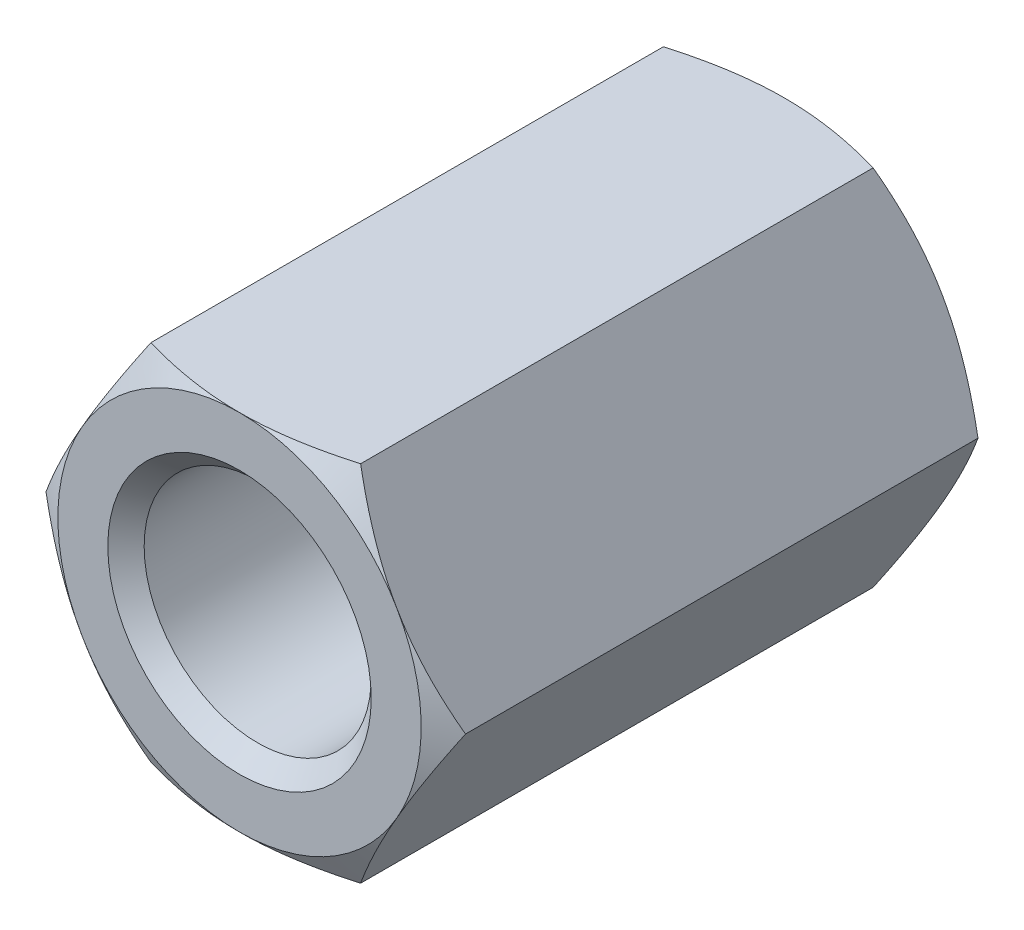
from build123d import *

# Parameters (mm, degrees)
BOSS_EXTRUDE1_DEPTH      = 6
SKETCH2_OUTSIDE_W        = 47.09
SKETCH2_OUTSIDE_H        = 45.852
SKETCH2_OUTSIDE_R        = 4
CUT_EXTRUDE1_DEPTH       = 9.563488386
CUT_EXTRUDE1_DRAFT       = -60
SKETCH3_R                = 2.5
SKETCH3_R_2              = 2.1
CUT_EXTRUDE2_DEPTH       = 6
SKETCH3_2_R              = 2.1
CUT_EXTRUDE3_DEPTH       = 7.2
CHAMFER1_SIZE            = 0.4
MIRROR1_COPY_1_SKETCH_W  = 47.09
MIRROR1_COPY_1_SKETCH_H  = 45.852
MIRROR1_COPY_1_SKETCH_R  = 4
MIRROR1_COPY_1_DEPTH     = 9.563488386
MIRROR1_COPY_1_DRAFT     = -60
CHAMFER1_OF_MIRROR1_SIZE = 0.4


with BuildPart() as part:
    # Sketch1 → Boss-Extrude1 (new body)
    with BuildSketch(Plane.XY):
        Polygon((2.309401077, 4), (-2.309401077, 4), (-4.618802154, 0), (-2.309401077, -4), (2.309401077, -4), (4.618802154, 0), align=None)
    boss_extrude1 = extrude(amount=-BOSS_EXTRUDE1_DEPTH)


with BuildPart() as cut_extrude1_tool:
    # Sketch2 outside → Cut-Extrude1 (with draft: the straight prism first)
    with BuildSketch(Plane(origin=(0, 0, -6), x_dir=(-1, 0, 0), z_dir=(0, 0, -1))):
        Rectangle(SKETCH2_OUTSIDE_W, SKETCH2_OUTSIDE_H)
        Circle(SKETCH2_OUTSIDE_R, mode=Mode.SUBTRACT)
    extrude(amount=-CUT_EXTRUDE1_DEPTH)
    # Cut-Extrude1: the draft: its side faces are tilted about the plane it starts from
    cut_extrude1_sides = [cut_extrude1_tool.faces().sort_by_distance(p)[0] for p in [
        (0, -22.926, -1.218255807),
        (-23.545, 0, -1.218255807),
        (0, 22.926, -1.218255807),
        (23.545, 0, -1.218255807),
        (4, 0, -1.218255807),
    ]]
    draft(cut_extrude1_sides, Plane(origin=(0, 0, -6), x_dir=(-1, 0, 0), z_dir=(0, 0, -1)), CUT_EXTRUDE1_DRAFT)


with BuildPart() as part_1:
    add(part.part)

    # Cut-Extrude1: cut by cut_extrude1_tool
    add(cut_extrude1_tool.part, mode=Mode.SUBTRACT)

    # Sketch3 → Cut-Extrude2 (cut)
    with BuildSketch(Plane(origin=(0, 0, -6), x_dir=(-1, 0, 0), z_dir=(0, 0, -1))):
        Circle(SKETCH3_R)
        Circle(SKETCH3_R_2, mode=Mode.SUBTRACT)
    cut_extrude2 = extrude(amount=-CUT_EXTRUDE2_DEPTH, mode=Mode.SUBTRACT)


with BuildPart() as cut_extrude2_piece_1:
    # of the separate pieces the step leaves, piece 1, a body of its own (cut_extrude2_pieces)
    add(part_1.part.solids().sort_by_distance((2.309401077, 4, 0))[0])

    # Chamfer1
    chamfer1_edges = [cut_extrude2_piece_1.edges().sort_by_distance(p)[0] for p in [
        (2.5, 0, -6),
    ]]
    chamfer(chamfer1_edges, length=CHAMFER1_SIZE)


with BuildPart() as cut_extrude2_piece_2:
    # of the separate pieces the step leaves, piece 2, a body of its own (cut_extrude2_pieces)
    add(part_1.part.solids().sort_by_distance((-2.1, 0, 0))[0])

    # Sketch3_2 → Cut-Extrude3 (cut)
    with BuildSketch(Plane(origin=(0, 0, -6), x_dir=(-1, 0, 0), z_dir=(0, 0, -1))):
        Circle(SKETCH3_2_R)
    cut_extrude3 = extrude(amount=-CUT_EXTRUDE3_DEPTH, mode=Mode.SUBTRACT)


with BuildPart() as cut_extrude2_piece_1_1:
    add(cut_extrude2_piece_1.part)

    # Mirror1: Boss-Extrude1, Cut-Extrude2, Cut-Extrude3 across plane
    add(boss_extrude1.mirror(Plane.XY))
    add(cut_extrude2.mirror(Plane.XY), mode=Mode.SUBTRACT)
    add(cut_extrude3.mirror(Plane.XY), mode=Mode.SUBTRACT)


with BuildPart() as mirror1_copy_1_tool:
    # Mirror1 copy 1 sketch → Mirror1 copy 1 (with draft: the straight prism first)
    with BuildSketch(Plane(origin=(0, 0, 6), x_dir=(-1, 0, 0), z_dir=(0, 0, 1))):
        Rectangle(MIRROR1_COPY_1_SKETCH_W, MIRROR1_COPY_1_SKETCH_H)
        Circle(MIRROR1_COPY_1_SKETCH_R, mode=Mode.SUBTRACT)
    extrude(amount=-MIRROR1_COPY_1_DEPTH)
    # Mirror1 copy 1: the draft: its side faces are tilted about the plane it starts from
    mirror1_copy_1_sides = [mirror1_copy_1_tool.faces().sort_by_distance(p)[0] for p in [
        (0, -22.926, 1.218255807),
        (-23.545, 0, 1.218255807),
        (0, 22.926, 1.218255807),
        (23.545, 0, 1.218255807),
        (4, 0, 1.218255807),
    ]]
    draft(mirror1_copy_1_sides, Plane(origin=(0, 0, 6), x_dir=(-1, 0, 0), z_dir=(0, 0, 1)), MIRROR1_COPY_1_DRAFT)


with BuildPart() as cut_extrude2_piece_1_2:
    add(cut_extrude2_piece_1_1.part)

    # Mirror1 copy 1: cut by mirror1_copy_1_tool
    add(mirror1_copy_1_tool.part, mode=Mode.SUBTRACT)

    # Chamfer1 of Mirror1
    chamfer1_of_mirror1_edges = [cut_extrude2_piece_1_2.edges().sort_by_distance(p)[0] for p in [
        (2.5, 0, 6),
    ]]
    chamfer(chamfer1_of_mirror1_edges, length=CHAMFER1_OF_MIRROR1_SIZE)


solid = cut_extrude2_piece_1_2.part
